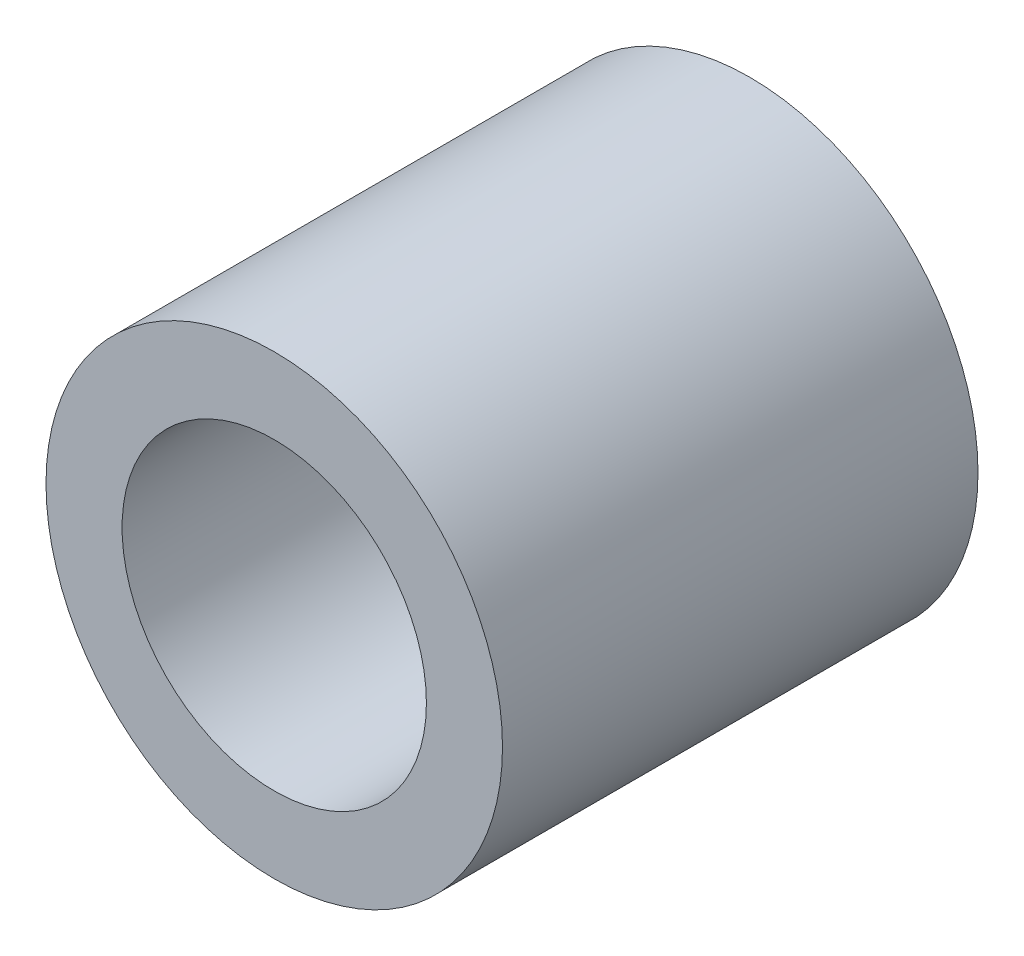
from build123d import *

# Parameters (mm, degrees)
ESQUISSE1_R          = 12
ESQUISSE1_R_2        = 8
BASE_EXTRUSION_DEPTH = 25


with BuildPart() as part:
    # Esquisse1 → Base-Extrusion (new body)
    with BuildSketch(Plane.XY):
        with Locations((0, 98)):
            Circle(ESQUISSE1_R)
        with Locations((0, 98)):
            Circle(ESQUISSE1_R_2, mode=Mode.SUBTRACT)
    extrude(amount=-BASE_EXTRUSION_DEPTH)


solid = part.part
